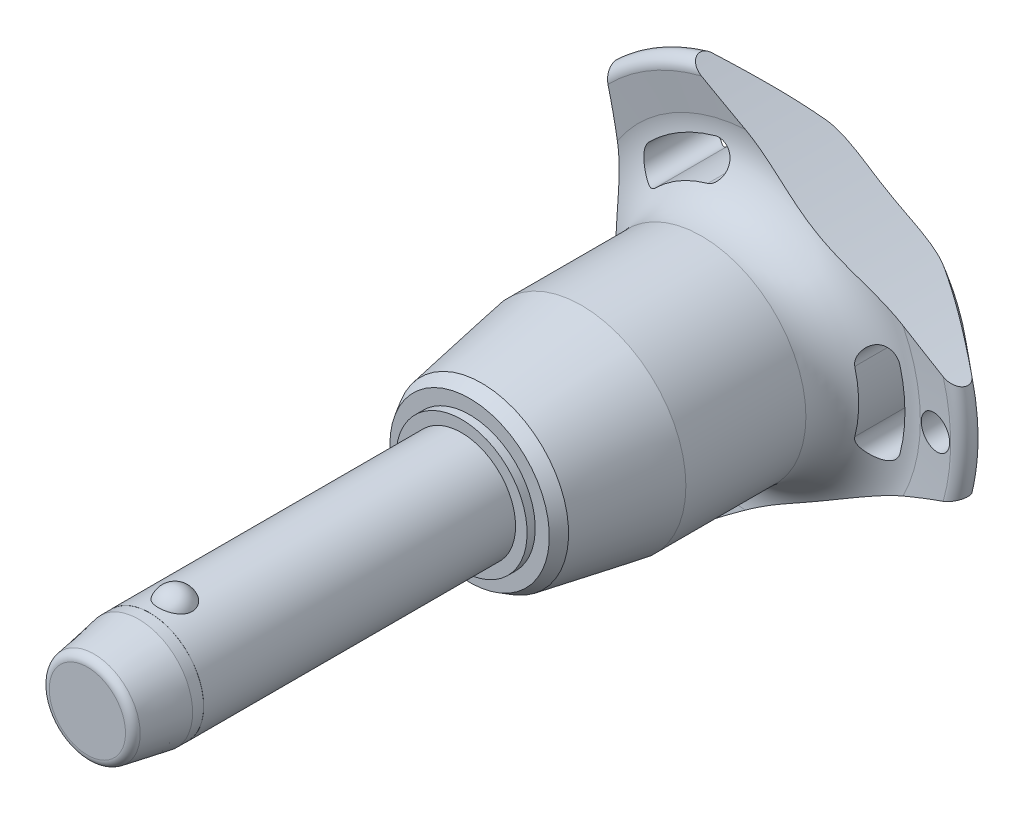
from build123d import *

# Parameters (mm, degrees)
SKETCH1_R           = 5
BOSS_EXTRUDE1_DEPTH = 25
SKETCH2_R           = 4.25
BOSS_EXTRUDE2_DEPTH = 33.3
BOSS_EXTRUDE3_START = 9.6
SKETCH1_2_R         = 5
BOSS_EXTRUDE3_DEPTH = 9.6
CHAMFER1_SIZE       = 4.8
CHAMFER1_SIZE2      = 0.846369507
FILLET1_R           = 0.75
SKETCH6_R           = 102.8
CUT_EXTRUDE1_DEPTH  = 65.557185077
CIRPATTERN1_COUNT   = 3
SKETCH7_R           = 1.5
CUT_EXTRUDE2_DEPTH  = 65.306162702
SKETCH8_R           = 5
SKETCH8_R_2         = 4.99
CUT_EXTRUDE3_DEPTH  = 5.76


with BuildPart() as part:
    # Sketch1 → Boss-Extrude1 (new body)
    with BuildSketch(Plane.XY):
        Circle(SKETCH1_R)
    extrude(amount=-BOSS_EXTRUDE1_DEPTH)

    # Sketch2 → Boss-Extrude2 (add)
    with BuildSketch(Plane(origin=(0, 0, -25), x_dir=(-1, 0, 0), z_dir=(0, 0, -1))):
        Circle(SKETCH2_R)
    extrude(amount=BOSS_EXTRUDE2_DEPTH)

    # Sketch3 → Revolve1 (revolve)
    with BuildSketch(Plane(origin=(0, 0, 0), x_dir=(0, 0, -1), z_dir=(1, 0, 0))):
        with BuildLine():
            Line((-1.516575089, 6), (-1.516575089, 2.7))
            ThreePointArc((-1.516575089, 2.7), (0.133424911, 4.35), (-1.516575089, 6))
        make_face()
        with BuildLine():
            Line((-1.516575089, -2.7), (-1.516575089, -6))
            ThreePointArc((-1.516575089, -6), (0.133424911, -4.35), (-1.516575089, -2.7))
        make_face()
    revolve(axis=Axis((0, -2.7, 1.516575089), (0, 1, 0)))

    # Sketch1_2 → Boss-Extrude3 (add)
    with BuildSketch(Plane.XY.offset(BOSS_EXTRUDE3_START)):
        Circle(SKETCH1_2_R)
    extrude(amount=-BOSS_EXTRUDE3_DEPTH)

    # Chamfer1
    chamfer1_edges = [part.edges().sort_by_distance(p)[0] for p in [
        (-5, 0, 9.6),
    ]]
    chamfer1_side = [part.faces().sort_by_distance(p)[0] for p in [
        (-5, 0, -7.7),
    ]]
    chamfer(chamfer1_edges, length=CHAMFER1_SIZE, length2=CHAMFER1_SIZE2, reference=chamfer1_side[0])

    # Fillet1
    fillet1_edges = [part.edges().sort_by_distance(p)[0] for p in [
        (-4.153630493, 0, 9.6),
        (4.25, 0, -58.3),
    ]]
    fillet(fillet1_edges, radius=FILLET1_R)

    # Sketch4 → Revolve2 (revolve)
    with BuildSketch(Plane(origin=(0, 0, 0), x_dir=(0, 0, -1), z_dir=(1, 0, 0)), mode=Mode.PRIVATE) as revolve2_sk:
        Polygon((25, 0), (25, 6.067402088), (25.75, 6.067402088), (25.75, 7.371950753), (26.879772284, 8.024225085), (36.1, 9.65), (47.2, 9.65), (47.2, 0), align=None)
    revolve(revolve2_sk.sketch.rotate(Axis((0, 0, -47.2), (0, 0, 1)), 90), axis=Axis((0, 0, -47.2), (0, 0, 1)))

    # Sketch5 → Revolve3 (revolve)
    with BuildSketch(Plane(origin=(0, 0, 0), x_dir=(0, 0, -1), z_dir=(1, 0, 0)), mode=Mode.PRIVATE) as revolve3_sk:
        with BuildLine():
            Line((52.16082631, 15.274661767), (51.757834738, 18.475067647))
            ThreePointArc((51.757834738, 18.475067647), (52.349836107, 19.516443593), (53.516044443, 19.24278761))
            Line((53.516044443, 19.24278761), (57.835691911, 14.094832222))
            ThreePointArc((57.835691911, 14.094832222), (58.3, 12.689260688), (57.67067517, 11.349423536))
            ThreePointArc((57.67067517, 11.349423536), (54.033110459, 6.185112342), (52.75, 0))
            Line((52.75, 0), (47.2, 0))
            Line((47.2, 0), (47.2, 9.65))
            ThreePointArc((47.2, 9.65), (50.949887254, 11.342683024), (52.16082631, 15.274661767))
        make_face()
    revolve(revolve3_sk.sketch.rotate(Axis((0, 0, -52.75), (0, 0, 1)), 90), axis=Axis((0, 0, -52.75), (0, 0, 1)))

    # Sketch6 → Cut-Extrude1 (cut, through all)
    with BuildSketch(Plane.XY):
        with Locations((-115.2, 0)):
            Circle(SKETCH6_R)
        with BuildLine():
            ThreePointArc((13.411913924, -3.529271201), (13.868496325, 0), (13.411913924, 3.529271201))
            ThreePointArc((13.411913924, 3.529271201), (11.694200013, 4.531299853), (10.692171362, 2.813585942))
            ThreePointArc((10.692171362, 2.813585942), (11.056165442, 0), (10.692171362, -2.813585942))
            ThreePointArc((10.692171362, -2.813585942), (11.694200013, -4.531299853), (13.411913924, -3.529271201))
        make_face()
    cut_extrude1 = extrude(amount=-CUT_EXTRUDE1_DEPTH, mode=Mode.SUBTRACT)

    # CirPattern1: Cut-Extrude1 ×3 about axis
    cirpattern1_axis = Axis((0, 0, 0), (0, 0, 1))
    for i in range(1, CIRPATTERN1_COUNT):
        add(cut_extrude1.rotate(cirpattern1_axis, i * 360 / CIRPATTERN1_COUNT), mode=Mode.SUBTRACT)

    # Sketch7 → Cut-Extrude2 (cut, through all)
    with BuildSketch(Plane.XY):
        with Locations(Location((16.868496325, 0, 0), (0, 0, 225.467095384))):
            Circle(SKETCH7_R)
    extrude(amount=-CUT_EXTRUDE2_DEPTH, mode=Mode.SUBTRACT)

    # Sketch8 → Cut-Extrude3 (cut)
    with BuildSketch(Plane.XY.offset(9.6)):
        Circle(SKETCH8_R)
        Circle(SKETCH8_R_2, mode=Mode.SUBTRACT)
    extrude(amount=-CUT_EXTRUDE3_DEPTH, mode=Mode.SUBTRACT)


solid = part.part
